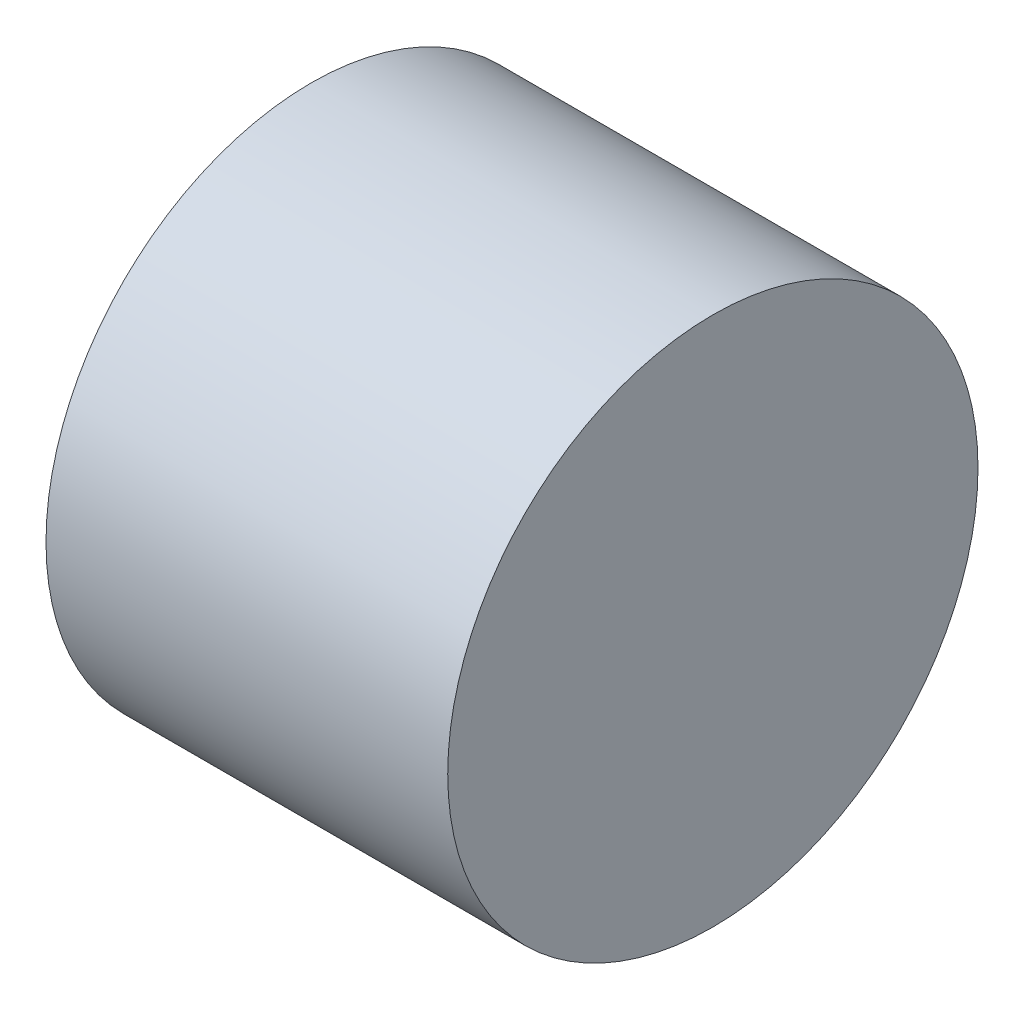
ISO-10303-21;
HEADER;
FILE_DESCRIPTION(('STEP AP214'),'2;1');
FILE_NAME('part.step','',(''),(''),'','','');
FILE_SCHEMA(('AUTOMOTIVE_DESIGN { 1 0 10303 214 1 1 1 1 }'));
ENDSEC;
DATA;
#1=APPLICATION_CONTEXT('core data for automotive mechanical design processes');
#2=APPLICATION_PROTOCOL_DEFINITION('international standard','automotive_design',2000,#1);
#3=PRODUCT_CONTEXT('',#1,'mechanical');
#4=PRODUCT('Part','Part','',(#3));
#5=PRODUCT_RELATED_PRODUCT_CATEGORY('part','',(#4));
#6=PRODUCT_DEFINITION_FORMATION('','',#4);
#7=PRODUCT_DEFINITION_CONTEXT('part definition',#1,'design');
#8=PRODUCT_DEFINITION('design','',#6,#7);
#9=PRODUCT_DEFINITION_SHAPE('','',#8);
#10=(LENGTH_UNIT() NAMED_UNIT(*) SI_UNIT(.MILLI.,.METRE.));
#11=(NAMED_UNIT(*) PLANE_ANGLE_UNIT() SI_UNIT($,.RADIAN.));
#12=(NAMED_UNIT(*) SI_UNIT($,.STERADIAN.) SOLID_ANGLE_UNIT());
#13=UNCERTAINTY_MEASURE_WITH_UNIT(LENGTH_MEASURE(1.E-05),#10,'distance_accuracy_value','');
#14=(GEOMETRIC_REPRESENTATION_CONTEXT(3) GLOBAL_UNCERTAINTY_ASSIGNED_CONTEXT((#13)) GLOBAL_UNIT_ASSIGNED_CONTEXT((#10,
#11,#12)) REPRESENTATION_CONTEXT('',''));
#15=CARTESIAN_POINT('',(0.,0.,0.));
#16=DIRECTION('',(0.,0.,1.));
#17=DIRECTION('',(1.,0.,0.));
#18=AXIS2_PLACEMENT_3D('',#15,#16,#17);
#19=CARTESIAN_POINT('',(3.,0.,4.8));
#20=DIRECTION('',(1.,0.,0.));
#21=DIRECTION('',(0.,0.,-1.));
#22=AXIS2_PLACEMENT_3D('',#19,#20,#21);
#23=PLANE('',#22);
#24=CARTESIAN_POINT('',(3.,0.,4.8));
#25=DIRECTION('',(1.,0.,0.));
#26=DIRECTION('',(0.,0.,-1.));
#27=AXIS2_PLACEMENT_3D('',#24,#25,#26);
#28=CIRCLE('',#27,0.660000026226);
#29=CARTESIAN_POINT('',(3.,0.,4.139999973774));
#30=VERTEX_POINT('',#29);
#31=EDGE_CURVE('E18',#30,#30,#28,.F.);
#32=ORIENTED_EDGE('',*,*,#31,.F.);
#33=EDGE_LOOP('',(#32));
#34=FACE_BOUND('',#33,.T.);
#35=ADVANCED_FACE('F15',(#34),#23,.T.);
#36=CARTESIAN_POINT('',(2.,0.,4.8));
#37=DIRECTION('',(1.,0.,0.));
#38=DIRECTION('',(0.,0.,-1.));
#39=AXIS2_PLACEMENT_3D('',#36,#37,#38);
#40=PLANE('',#39);
#41=CARTESIAN_POINT('',(2.,0.,4.8));
#42=DIRECTION('',(1.,0.,0.));
#43=DIRECTION('',(0.,0.,-1.));
#44=AXIS2_PLACEMENT_3D('',#41,#42,#43);
#45=CIRCLE('',#44,0.660000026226);
#46=CARTESIAN_POINT('',(2.,0.,4.139999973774));
#47=VERTEX_POINT('',#46);
#48=EDGE_CURVE('E10',#47,#47,#45,.T.);
#49=ORIENTED_EDGE('',*,*,#48,.F.);
#50=EDGE_LOOP('',(#49));
#51=FACE_BOUND('',#50,.T.);
#52=ADVANCED_FACE('F30',(#51),#40,.F.);
#53=CARTESIAN_POINT('',(2.,0.,4.8));
#54=DIRECTION('',(1.,0.,0.));
#55=DIRECTION('',(0.,0.,-1.));
#56=AXIS2_PLACEMENT_3D('',#53,#54,#55);
#57=CYLINDRICAL_SURFACE('',#56,0.660000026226);
#58=ORIENTED_EDGE('',*,*,#48,.T.);
#59=EDGE_LOOP('',(#58));
#60=FACE_BOUND('',#59,.T.);
#61=ORIENTED_EDGE('',*,*,#31,.T.);
#62=EDGE_LOOP('',(#61));
#63=FACE_BOUND('',#62,.T.);
#64=ADVANCED_FACE('F27',(#60,#63),#57,.T.);
#65=CLOSED_SHELL('',(#35,#52,#64));
#66=MANIFOLD_SOLID_BREP('B1',#65);
#67=ADVANCED_BREP_SHAPE_REPRESENTATION('',(#18,#66),#14);
#68=SHAPE_DEFINITION_REPRESENTATION(#9,#67);
ENDSEC;
END-ISO-10303-21;
